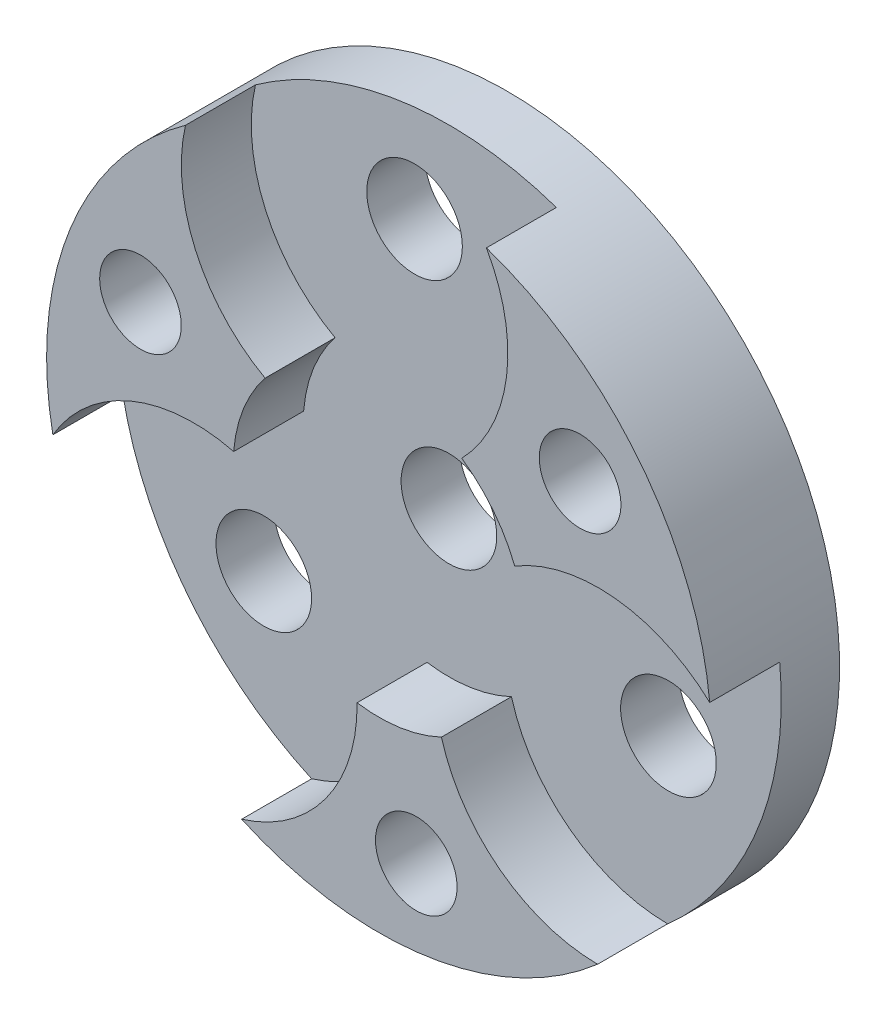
from build123d import *

# Parameters (mm, degrees)
ESQUISSE1_W                     = 2.85
ESQUISSE1_H                     = 1.1
ENL_V_MAT_EXTRU_1_DEPTH         = 0.6
BOSS_EXTRU_1_START              = 0.6
BOSS_EXTRU_1_DEPTH              = 0.6
BOSS_EXTRU_2_START              = 0.6
BOSS_EXTRU_2_DEPTH              = 0.6
PER_AGE1_D                      = 0.82
DIAM_TRE_DU_PER_AGE_0_7_0_7_1_D = 0.7


with BuildPart() as part:
    # Esquisse1 → R_volution1 (revolve)
    with BuildSketch(Plane.XZ, mode=Mode.PRIVATE) as r_volution1_sk:
        with Locations((1.425, 3.1)):
            Rectangle(ESQUISSE1_W, ESQUISSE1_H)
    revolve(r_volution1_sk.sketch.rotate(Axis((0, 0, 3.65), (0, 0, -1)), 180), axis=Axis((0, 0, 3.65), (0, 0, -1)))

    # Esquisse2 → Enl_v. mat.-Extru.1 (cut)
    with BuildSketch(Plane.XY.offset(3.65)):
        with BuildLine():
            ThreePointArc((-1.659079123, 2.317316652), (-1.57413044, 1.435015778), (-0.97632605, 0.780568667))
            ThreePointArc((-0.97632605, 0.780568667), (-1.161967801, 0.460793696), (-1.245937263, 0.100699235))
            ThreePointArc((-1.245937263, 0.100699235), (-2.129791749, 0.033823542), (-2.796335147, -0.550463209))
            ThreePointArc((-2.796335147, -0.550463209), (2.649286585, -1.050609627), (-1.659079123, 2.317316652))
        make_face()
    extrude(amount=-ENL_V_MAT_EXTRU_1_DEPTH, mode=Mode.SUBTRACT)

    # Esquisse3 → Boss.-Extru.1 (add)
    with BuildSketch(Plane.XY.offset(3.05).offset(BOSS_EXTRU_1_START)):
        with BuildLine():
            ThreePointArc((1.16415532, 0.455238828), (0.980042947, 0.775896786), (0.710176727, 1.028663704))
            ThreePointArc((0.710176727, 1.028663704), (1.094187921, 1.827541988), (0.921452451, 2.696928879))
            ThreePointArc((0.921452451, 2.696928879), (2.234497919, 1.769044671), (2.83639465, 0.278146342))
            ThreePointArc((2.83639465, 0.278146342), (2.029825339, 0.64572906), (1.16415532, 0.455238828))
        make_face()
    extrude(amount=-BOSS_EXTRU_1_DEPTH)

    # Esquisse4 → Boss.-Extru.2 (add)
    with BuildSketch(Plane.XY.offset(3.05).offset(BOSS_EXTRU_2_START)):
        with BuildLine():
            ThreePointArc((-0.18782927, -1.235807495), (0.181924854, -1.236690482), (0.535760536, -1.129362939))
            ThreePointArc((0.535760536, -1.129362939), (1.035603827, -1.86136553), (1.874882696, -2.146465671))
            ThreePointArc((1.874882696, -2.146465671), (0.414788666, -2.819654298), (-1.177315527, -2.595462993))
            ThreePointArc((-1.177315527, -2.595462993), (-0.455694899, -2.080744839), (-0.18782927, -1.235807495))
        make_face()
    extrude(amount=-BOSS_EXTRU_2_DEPTH)

    # Per_age1 (through all)
    with Locations(Plane.XY.offset(3.05)):
        with Locations((-0.294718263, 2.00343858), (-1.587669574, -1.256952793), (1.882387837, -0.746485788), (0, 0)):
            Hole(PER_AGE1_D / 2)

    # Diam_tre du per_age _0.7 _0.7_1 (through all)
    with Locations(Plane(origin=(0, 0, 2.55), x_dir=(-1, 0, 0), z_dir=(0, 0, -1))):
        with Locations((-1.724875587, 1.365578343), (2.045063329, 0.810996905), (-0.320187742, -2.176575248)):
            Hole(DIAM_TRE_DU_PER_AGE_0_7_0_7_1_D / 2)


solid = part.part
